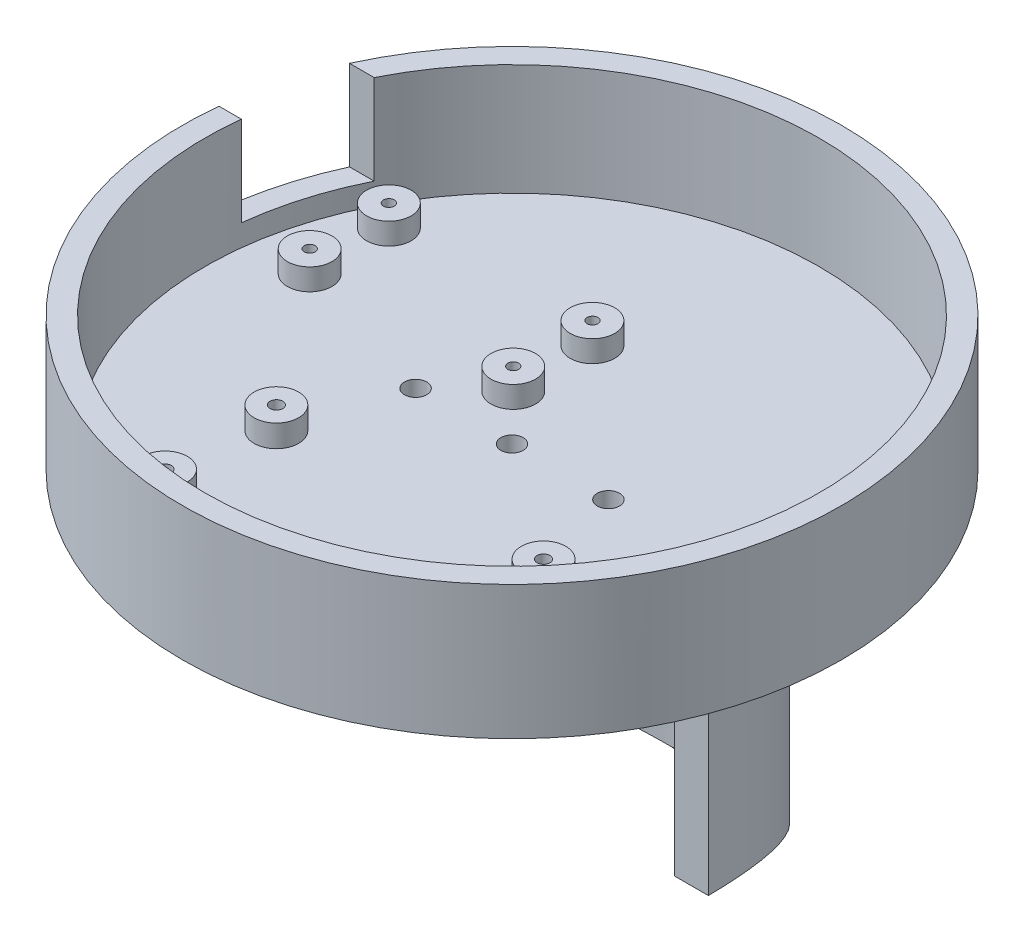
from build123d import *
from build123d.topology import SkipClean

# Parameters (mm, degrees)
SKETCH1_R                       = 74
BOSS_EXTRUDE1_DEPTH             = 20
BOSS_EXTRUDE2_DEPTH             = 70
BOSS_EXTRUDE3_DEPTH             = 70
TAP_DRILL_FOR_M6X1_0_TAP1_D     = 5
CUT_EXTRUDE7_DEPTH              = 210.040803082
CUT_EXTRUDE7_DEPTH_BACK         = 210.040803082
SKETCH14_RX                     = 50.651437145
SKETCH14_RY                     = 39.339662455
SKETCH14_W                      = 59.614105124
SKETCH14_H                      = 39.742736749
SKETCH15_R                      = 71.5
CUT_EXTRUDE8_DEPTH              = 15
SKETCH23_R                      = 74
SKETCH23_R_2                    = 71.5
BOSS_EXTRUDE10_DEPTH            = 25
BOSS_EXTRUDE12_START            = 25
SKETCH33_R                      = 71.5
SKETCH33_R_2                    = 69
BOSS_EXTRUDE12_DEPTH            = 25
SKETCH34_W                      = 51
SKETCH34_H                      = 23
BOSS_EXTRUDE13_DEPTH            = 5
F_41_0_096_DIAMETER_HOLE1_D     = 2.4384
F_41_0_096_DIAMETER_HOLE1_DEPTH = 5
F_41_0_096_DIAMETER_HOLE1_TIP   = 0.732569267
CUT_EXTRUDE9_DEPTH              = 148
SKETCH40_R                      = 5
BOSS_EXTRUDE15_DEPTH            = 5
F_33_0_113_DIAMETER_HOLE1_D     = 2.8702
F_33_0_113_DIAMETER_HOLE1_DEPTH = 5
F_33_0_113_DIAMETER_HOLE1_TIP   = 0.862295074
BOSS_EXTRUDE17_START            = -4.851421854
SKETCH44_R                      = 5
SKETCH44_R_2                    = 1.2192
BOSS_EXTRUDE17_DEPTH            = 4.851421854
CUT_EXTRUDE14_START             = -4.851421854
CUT_EXTRUDE14_DEPTH             = 4.851421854


with BuildPart() as part:
    # Sketch1 → Boss-Extrude1 (new body)
    with BuildSketch(Plane(origin=(0, 0, 0), x_dir=(1, 0, 0), z_dir=(0, 1, 0))):
        with Locations(Location((-36.50845833, 35.022648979, 0), (0, 0, 270))):
            Circle(SKETCH1_R)
    extrude(amount=BOSS_EXTRUDE1_DEPTH)

    # Sketch3 → Boss-Extrude2 (add)
    with BuildSketch(Plane(origin=(0, 0, 0), x_dir=(-1, 0, 0), z_dir=(0, -1, 0))):
        with BuildLine():
            Line((-7.591784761, 35.022648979), (0, 35.022648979))
            ThreePointArc((0, 35.022648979), (36.50845833, 71.53110731), (73.01691666, 35.022648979))
            Line((73.01691666, 35.022648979), (80.608701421, 35.022648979))
            ThreePointArc((80.608701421, 35.022648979), (36.50845833, 79.12289207), (-7.591784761, 35.022648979))
        make_face()
    extrude(amount=BOSS_EXTRUDE2_DEPTH)

    # Sketch6 → Boss-Extrude3 (add)
    with BuildSketch(Plane.XZ.offset(70)):
        with BuildLine():
            Line((7.591784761, -35.022648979), (0, -35.022648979))
            ThreePointArc((0, -35.022648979), (-36.50845833, -71.53110731), (-73.01691666, -35.022648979))
            Line((-73.01691666, -35.022648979), (-80.608701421, -35.022648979))
            ThreePointArc((-80.608701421, -35.022648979), (-36.50845833, -79.12289207), (7.591784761, -35.022648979))
        make_face()
    extrude(amount=BOSS_EXTRUDE3_DEPTH)

    # Tap Drill for M6x1.0 Tap1 (through all)
    with Locations(Plane(origin=(0, 0, 0), x_dir=(-1, 0, 0), z_dir=(0, -1, 0))):
        with Locations((36.50845833, 35.022648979), (14.85845833, 35.022648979), (58.15845833, 35.022648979)):
            Hole(TAP_DRILL_FOR_M6X1_0_TAP1_D / 2)

    # Sketch14 → Cut-Extrude7 (cut, two sides: drawn at the far end of the back side and taken through both)
    with BuildSketch(Plane(origin=(0, 0, 0), x_dir=(0, 0, -1), z_dir=(1, 0, 0)).offset(-CUT_EXTRUDE7_DEPTH_BACK)):
        with Locations(Location((35.022648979, -100.124878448), (0, 0, -178.486878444))):
            Ellipse(SKETCH14_RX, SKETCH14_RY)
        with Locations((64.829701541, -133.753348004)):
            Rectangle(SKETCH14_W, SKETCH14_H)
        with BuildLine():
            Line((35.022648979, -139.469983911), (35.022648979, -113.88197963))
            Line((35.022648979, -113.88197963), (82.227917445, -113.88197963))
            add(Edge.make_bspline(
                [(82.227917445, -113.88197963), (104.563270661, -68.996459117), (43.843677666, -61.288765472), (-16.87591533, -53.581071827), (-15.611126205, -101.462374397)],
                knots=[2.75042936, 2.75042936, 2.75042936, 4.516807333, 4.516807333, 6.283185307, 6.283185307, 6.283185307], degree=2, weights=[1, 0.634690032, 1, 0.634690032, 1]))
            add(Edge.make_bspline(
                [(-15.611126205, -101.462374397), (-14.593420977, -139.98978661), (35.022648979, -139.469983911)],
                knots=[0, 0, 0, 1.550283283, 1.550283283, 1.550283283], degree=2, weights=[1, 0.714321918, 1]))
        make_face()
        with BuildLine():
            Line((82.227917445, -113.88197963), (35.022648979, -113.88197963))
            Line((35.022648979, -113.88197963), (35.022648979, -139.469983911))
            add(Edge.make_bspline(
                [(35.022648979, -139.469983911), (69.675798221, -139.106940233), (82.227917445, -113.88197963)],
                knots=[1.550283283, 1.550283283, 1.550283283, 2.75042936, 2.75042936, 2.75042936], degree=2, weights=[1, 0.825294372, 1]))
        make_face()
        with BuildLine():
            Line((35.022648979, -139.469983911), (35.022648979, -113.88197963))
            Line((35.022648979, -113.88197963), (82.227917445, -113.88197963))
            add(Edge.make_bspline(
                [(82.227917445, -113.88197963), (104.563270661, -68.996459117), (43.843677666, -61.288765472), (-16.87591533, -53.581071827), (-15.611126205, -101.462374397)],
                knots=[2.75042936, 2.75042936, 2.75042936, 4.516807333, 4.516807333, 6.283185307, 6.283185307, 6.283185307], degree=2, weights=[1, 0.634690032, 1, 0.634690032, 1]))
            add(Edge.make_bspline(
                [(-15.611126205, -101.462374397), (-14.593420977, -139.98978661), (35.022648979, -139.469983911)],
                knots=[0, 0, 0, 1.550283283, 1.550283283, 1.550283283], degree=2, weights=[1, 0.714321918, 1]))
        make_face()
        with BuildLine():
            Line((82.227917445, -113.88197963), (35.022648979, -113.88197963))
            Line((35.022648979, -113.88197963), (35.022648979, -139.469983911))
            add(Edge.make_bspline(
                [(35.022648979, -139.469983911), (69.675798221, -139.106940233), (82.227917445, -113.88197963)],
                knots=[1.550283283, 1.550283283, 1.550283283, 2.75042936, 2.75042936, 2.75042936], degree=2, weights=[1, 0.825294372, 1]))
        make_face()
    extrude(amount=CUT_EXTRUDE7_DEPTH + CUT_EXTRUDE7_DEPTH_BACK, mode=Mode.SUBTRACT)

    # Sketch15 → Cut-Extrude8 (cut)
    with BuildSketch(Plane(origin=(0, 20, 0), x_dir=(1, 0, 0), z_dir=(0, 1, 0))):
        with Locations(Location((-36.50845833, 35.022648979, 0), (0, 0, 270))):
            Circle(SKETCH15_R)
    extrude(amount=-CUT_EXTRUDE8_DEPTH, mode=Mode.SUBTRACT)

    # Sketch23 → Boss-Extrude10 (add)
    with BuildSketch(Plane(origin=(0, 5, 0), x_dir=(1, 0, 0), z_dir=(0, 1, 0))):
        with Locations(Location((-36.50845833, 35.022648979, 0), (0, 0, 270))):
            Circle(SKETCH23_R)
        with Locations(Location((-36.50845833, 35.022648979, 0), (0, 0, 270))):
            Circle(SKETCH23_R_2, mode=Mode.SUBTRACT)
    extrude(amount=BOSS_EXTRUDE10_DEPTH)

    # Sketch33 → Boss-Extrude12 (add)
    with BuildSketch(Plane(origin=(0, 5, 0), x_dir=(1, 0, 0), z_dir=(0, 1, 0)).offset(BOSS_EXTRUDE12_START)):
        with Locations((-36.50845833, 35.022648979)):
            Circle(SKETCH33_R)
        with Locations(Location((-36.50845833, 35.022648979, 0), (0, 0, 270))):
            Circle(SKETCH33_R_2, mode=Mode.SUBTRACT)
    extrude(amount=-BOSS_EXTRUDE12_DEPTH)

    # Sketch34 → Boss-Extrude13 (add)
    with BuildSketch(Plane(origin=(0, 5, 0), x_dir=(1, 0, 0), z_dir=(0, 1, 0))):
        with Locations((-69.489305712, 54.3166983)):
            Rectangle(SKETCH34_W, SKETCH34_H)
    extrude(amount=BOSS_EXTRUDE13_DEPTH)

    # 41 _0.096_ Diameter Hole1
    with Locations(Plane(origin=(0, 10, 0), x_dir=(1, 0, 0), z_dir=(0, 1, 0))):
        with Locations((-92.349305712, 63.2066983), (-46.629305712, 63.2066983), (-46.629305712, 45.4266983), (-92.349305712, 45.4266983)):
            Hole(F_41_0_096_DIAMETER_HOLE1_D / 2, depth=F_41_0_096_DIAMETER_HOLE1_DEPTH)
            with Locations((0, 0, -(F_41_0_096_DIAMETER_HOLE1_DEPTH + F_41_0_096_DIAMETER_HOLE1_TIP / 2))):  # 118° drill point
                Cone(0, F_41_0_096_DIAMETER_HOLE1_D / 2, F_41_0_096_DIAMETER_HOLE1_TIP, mode=Mode.SUBTRACT)

    # 3DSketch1 → Cut-Extrude9 (cut)
    with BuildSketch(Plane(origin=(0, 9.851421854, -65.8166983), x_dir=(0, 0.9016785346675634, 0.43240700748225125), z_dir=(-1, 0, 0))):
        Polygon((0, 0), (43.245266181, 20.738606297), (53.190627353, 0), (9.945361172, -20.738606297), align=None)
    extrude(amount=CUT_EXTRUDE9_DEPTH, mode=Mode.SUBTRACT)

    # Sketch40 → Boss-Extrude15 (add)
    with BuildSketch(Plane(origin=(0, 5, 0), x_dir=(1, 0, 0), z_dir=(0, 1, 0))):
        with Locations(Location((-65.5722806, 11.170260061, 0), (0, 0, 270))):
            Circle(SKETCH40_R)
        with Locations(Location((-5.5722806, 11.170260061, 0), (0, 0, 270))):
            Circle(SKETCH40_R)
        with Locations(Location((-5.5722806, -13.829739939, 0), (0, 0, 270))):
            Circle(SKETCH40_R)
        with Locations(Location((-65.5722806, -13.829739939, 0), (0, 0, 270))):
            Circle(SKETCH40_R)
    extrude(amount=BOSS_EXTRUDE15_DEPTH)

    # 33 _0.113_ Diameter Hole1
    with Locations(Plane(origin=(0, 10, 0), x_dir=(1, 0, 0), z_dir=(0, 1, 0))):
        with Locations((-65.5722806, 11.170260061), (-5.5722806, 11.170260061), (-5.5722806, -13.829739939), (-65.5722806, -13.829739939)):
            Hole(F_33_0_113_DIAMETER_HOLE1_D / 2, depth=F_33_0_113_DIAMETER_HOLE1_DEPTH)
            with Locations((0, 0, -(F_33_0_113_DIAMETER_HOLE1_DEPTH + F_33_0_113_DIAMETER_HOLE1_TIP / 2))):  # 118° drill point
                Cone(0, F_33_0_113_DIAMETER_HOLE1_D / 2, F_33_0_113_DIAMETER_HOLE1_TIP, mode=Mode.SUBTRACT)

    # Sketch44 → Boss-Extrude17 (add)
    # profile 1 of 4: a face of its own
    with BuildSketch(Plane(origin=(0, 9.851421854, 0), x_dir=(1, 0, 0), z_dir=(0, 1, 0)).offset(BOSS_EXTRUDE17_START)):
        with Locations((-92.349305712, 63.2066983)):
            Circle(SKETCH44_R)
        with Locations(Location((-92.349305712, 63.2066983, 0), (0, 0, 270))):
            Circle(SKETCH44_R_2, mode=Mode.SUBTRACT)
    # profile 2 of 4: a face of its own
    with BuildSketch(Plane(origin=(0, 9.851421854, 0), x_dir=(1, 0, 0), z_dir=(0, 1, 0)).offset(BOSS_EXTRUDE17_START)):
        with Locations((-46.629305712, 63.2066983)):
            Circle(SKETCH44_R)
        with Locations(Location((-46.629305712, 63.2066983, 0), (0, 0, 270))):
            Circle(SKETCH44_R_2, mode=Mode.SUBTRACT)
    # profile 3 of 4: a face of its own
    with BuildSketch(Plane(origin=(0, 9.851421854, 0), x_dir=(1, 0, 0), z_dir=(0, 1, 0)).offset(BOSS_EXTRUDE17_START)):
        with Locations((-46.629305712, 45.4266983)):
            Circle(SKETCH44_R)
        with Locations(Location((-46.629305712, 45.4266983, 0), (0, 0, 270))):
            Circle(SKETCH44_R_2, mode=Mode.SUBTRACT)
    # profile 4 of 4: a face of its own
    with BuildSketch(Plane(origin=(0, 9.851421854, 0), x_dir=(1, 0, 0), z_dir=(0, 1, 0)).offset(BOSS_EXTRUDE17_START)):
        with Locations((-92.349305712, 45.4266983)):
            Circle(SKETCH44_R)
        with Locations(Location((-92.349305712, 45.4266983, 0), (0, 0, 270))):
            Circle(SKETCH44_R_2, mode=Mode.SUBTRACT)
    extrude(amount=BOSS_EXTRUDE17_DEPTH)

    # Sketch45 → Cut-Extrude14 (cut)
    with SkipClean():  # the faces are left unmerged after this step: merging them gives an invalid solid
        with BuildSketch(Plane(origin=(0, 9.851421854, 0), x_dir=(1, 0, 0), z_dir=(0, 1, 0)).offset(CUT_EXTRUDE14_START)):
            with BuildLine():
                Line((-94.989305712, 58.96047645), (-94.989305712, 49.67292015))
                ThreePointArc((-94.989305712, 49.67292015), (-89.920314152, 49.797052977), (-87.349305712, 45.4266983))
                ThreePointArc((-87.349305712, 45.4266983), (-87.536633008, 44.070902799), (-88.084578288, 42.8166983))
                Line((-88.084578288, 42.8166983), (-50.894033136, 42.8166983))
                ThreePointArc((-50.894033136, 42.8166983), (-50.15235543, 48.974672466), (-43.989305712, 49.67292015))
                Line((-43.989305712, 49.67292015), (-43.989305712, 58.96047645))
                ThreePointArc((-43.989305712, 58.96047645), (-50.15235543, 59.658724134), (-50.894033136, 65.8166983))
                Line((-50.894033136, 65.8166983), (-88.084578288, 65.8166983))
                ThreePointArc((-88.084578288, 65.8166983), (-87.536633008, 64.562493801), (-87.349305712, 63.2066983))
                ThreePointArc((-87.349305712, 63.2066983), (-89.920314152, 58.836343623), (-94.989305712, 58.96047645))
            make_face()
        extrude(amount=CUT_EXTRUDE14_DEPTH, mode=Mode.SUBTRACT)


solid = part.part
